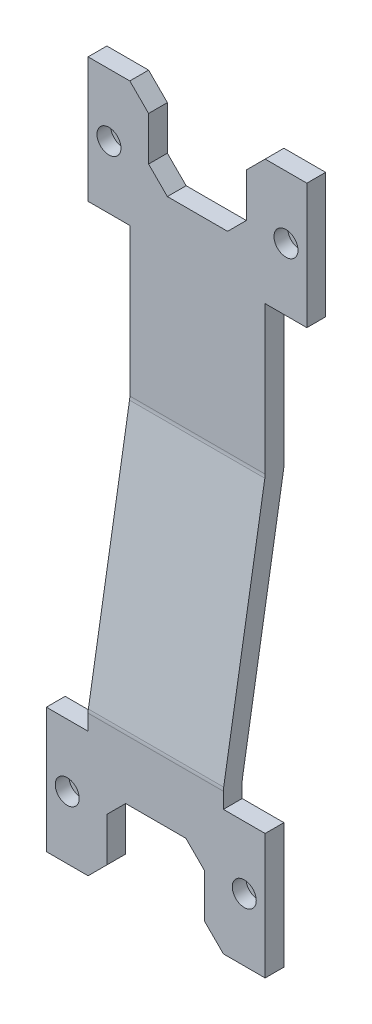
from build123d import *

# Parameters (mm, degrees)
SALIENTE_EXTRUIR1_DEPTH = 5
SALIENTE_EXTRUIR2_DEPTH = 10
CORTAR_EXTRUIR1_DEPTH   = 97.811383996
CORTAR_EXTRUIR2_DEPTH   = 97.811383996
REDONDEO1_R             = 5
CROQUIS5_R              = 1.55
CORTAR_EXTRUIR3_DEPTH   = 86.502404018
CROQUIS6_R              = 2.875
CORTAR_EXTRUIR4_DEPTH   = 3.3
CROQUIS7_R              = 2.875
CORTAR_EXTRUIR5_DEPTH   = 3.3
CORTAR_EXTRUIR6_DEPTH   = 97.811383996


with BuildPart() as part:
    # Croquis1 → Saliente-Extruir1 (new body)
    with BuildSketch(Plane.XY):
        Polygon((-16.215663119, 49.99), (-16.215663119, -49.99), (-26.215663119, -49.99), (-26.215663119, -79.99), (-16.215663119, -79.99), (-11.715663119, -75.49), (-11.715663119, -64.99), (-7.215663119, -60.49), (7.215663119, -60.49), (11.715663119, -64.99), (11.715663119, -75.49), (16.215663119, -79.99), (26.215663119, -79.99), (26.215663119, -49.99), (16.215663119, -49.99), (16.215663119, 49.99), (26.215663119, 49.99), (26.215663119, 79.99), (16.215663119, 79.99), (11.715663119, 75.49), (11.715663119, 64.99), (7.215663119, 60.49), (-7.215663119, 60.49), (-11.715663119, 64.99), (-11.715663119, 75.49), (-16.215663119, 79.99), (-26.215663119, 79.99), (-26.215663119, 49.99), align=None)
    extrude(amount=-SALIENTE_EXTRUIR1_DEPTH)

    # Croquis2 → Saliente-Extruir2 (add)
    with BuildSketch(Plane(origin=(0, 0, -5), x_dir=(-1, 0, 0), z_dir=(0, 0, -1))):
        Polygon((-16.215663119, -49.99), (16.215663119, -49.99), (16.215663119, 49.99), (26.215663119, 49.99), (26.215663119, 79.99), (16.215663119, 79.99), (11.715663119, 75.49), (11.715663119, 64.99), (7.215663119, 60.49), (-7.215663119, 60.49), (-11.715663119, 64.99), (-11.715663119, 75.49), (-16.215663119, 79.99), (-26.215663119, 79.99), (-26.215663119, 49.99), (-16.215663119, 49.99), align=None)
    extrude(amount=SALIENTE_EXTRUIR2_DEPTH)

    # Croquis3 → Cortar-Extruir1 (cut, through all)
    with BuildSketch(Plane(origin=(26.215663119, 0, 0), x_dir=(0, 0, -1), z_dir=(1, 0, 0))):
        with BuildLine():
            Line((0, -46.232440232), (0, 79.99))
            Line((0, 79.99), (10, 79.994880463))
            Line((10, 79.994880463), (10, 14.595185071))
            ThreePointArc((10, 14.595185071), (9.98296338, 14.182782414), (9.931969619, 13.773190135))
            Line((9.931969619, 13.773190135), (0.068030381, -45.410445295))
            ThreePointArc((0.068030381, -45.410445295), (0.01703662, -45.820037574), (0, -46.232440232))
        make_face()
    extrude(amount=-CORTAR_EXTRUIR1_DEPTH, mode=Mode.SUBTRACT)

    # Croquis4 → Cortar-Extruir2 (cut, through all)
    with BuildSketch(Plane(origin=(26.215663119, 0, 0), x_dir=(0, 0, -1), z_dir=(1, 0, 0))):
        Polygon((15.262283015, 15.341257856), (15, -49.99), (5, -49.99), (5, -46.232440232), align=None)
    extrude(amount=-CORTAR_EXTRUIR2_DEPTH, mode=Mode.SUBTRACT)

    # Redondeo1
    redondeo1_edges = [part.edges().sort_by_distance(p)[0] for p in [
        (0, 13.767559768, -15),
        (0, -46.232440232, -5),
    ]]
    fillet(redondeo1_edges, radius=REDONDEO1_R)

    # Croquis5 → Cortar-Extruir3 (cut, through all)
    with BuildSketch(Plane.XY):
        with Locations((-21.215663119, -64.99)):
            Circle(CROQUIS5_R)
        with Locations((21.215663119, -64.99)):
            Circle(CROQUIS5_R)
        with Locations((21.215663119, 64.99)):
            Circle(CROQUIS5_R)
        with Locations((-21.215663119, 64.99)):
            Circle(CROQUIS5_R)
    extrude(amount=-CORTAR_EXTRUIR3_DEPTH, mode=Mode.SUBTRACT)

    # Croquis6 → Cortar-Extruir4 (cut)
    with BuildSketch(Plane.XY):
        with Locations((21.215663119, -64.99)):
            Circle(CROQUIS6_R)
        with Locations((-21.215663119, -64.99)):
            Circle(CROQUIS6_R)
        with Locations((-21.215663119, 64.99)):
            Circle(CROQUIS6_R)
        with Locations((21.215663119, 64.99)):
            Circle(CROQUIS6_R)
    extrude(amount=-CORTAR_EXTRUIR4_DEPTH, mode=Mode.SUBTRACT)

    # Croquis7 → Cortar-Extruir5 (cut)
    with BuildSketch(Plane.XY.offset(-10)):
        with Locations((-21.215663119, 64.99)):
            Circle(CROQUIS7_R)
        with Locations((21.215663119, 64.99)):
            Circle(CROQUIS7_R)
    extrude(amount=-CORTAR_EXTRUIR5_DEPTH, mode=Mode.SUBTRACT)

    # Croquis8 → Cortar-Extruir6 (cut, through all)
    with BuildSketch(Plane(origin=(26.215663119, 0, 0), x_dir=(0, 0, -1), z_dir=(1, 0, 0))):
        with BuildLine():
            Line((15, 79.99), (15, 49.99))
            Line((15, 49.99), (15, 14.18137242))
            ThreePointArc((15, 14.18137242), (14.98296338, 13.768969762), (14.931969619, 13.359377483))
            Line((14.931969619, 13.359377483), (5.068030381, -45.824257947))
            ThreePointArc((5.068030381, -45.824257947), (5.01703662, -46.233850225), (5, -46.646252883))
            Line((5, -46.646252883), (5, -49.99))
            Line((5, -49.99), (5, -79.99))
            Line((5, -79.99), (4.5, -79.99))
            Line((4.5, -79.99), (4.5, -49.99))
            Line((4.5, -49.99), (4.5, -46.646252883))
            ThreePointArc((4.5, -46.646252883), (4.518740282, -46.19260996), (4.574833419, -45.742058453))
            Line((4.574833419, -45.742058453), (14.438772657, 13.441576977))
            ThreePointArc((14.438772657, 13.441576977), (14.484667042, 13.810210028), (14.5, 14.18137242))
            Line((14.5, 14.18137242), (14.5, 49.99))
            Line((14.5, 49.99), (14.5, 79.99))
            Line((14.5, 79.99), (15, 79.99))
        make_face()
    extrude(amount=-CORTAR_EXTRUIR6_DEPTH, mode=Mode.SUBTRACT)


solid = part.part
